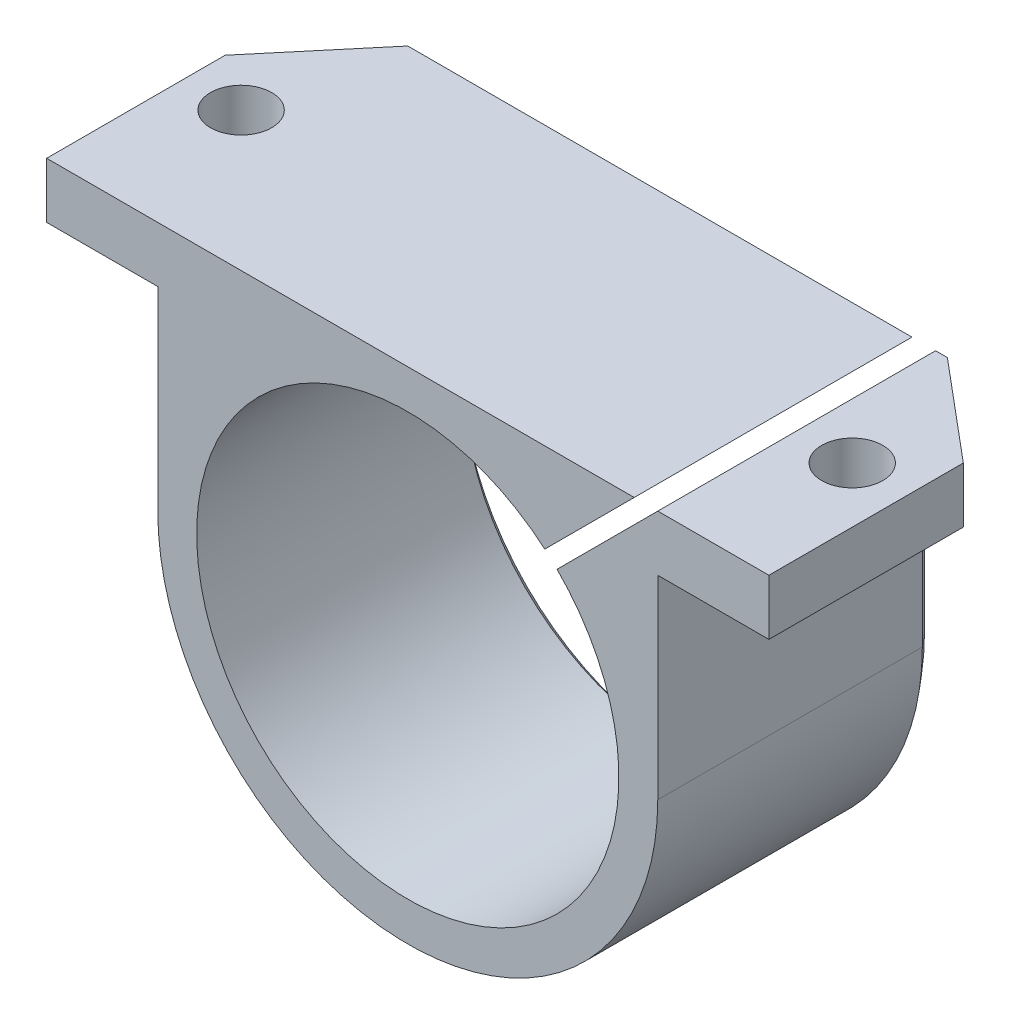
ISO-10303-21;
HEADER;
FILE_DESCRIPTION(('STEP AP214'),'2;1');
FILE_NAME('part.step','',(''),(''),'','','');
FILE_SCHEMA(('AUTOMOTIVE_DESIGN { 1 0 10303 214 1 1 1 1 }'));
ENDSEC;
DATA;
#1=APPLICATION_CONTEXT('core data for automotive mechanical design processes');
#2=APPLICATION_PROTOCOL_DEFINITION('international standard','automotive_design',2000,#1);
#3=PRODUCT_CONTEXT('',#1,'mechanical');
#4=PRODUCT('Part','Part','',(#3));
#5=PRODUCT_RELATED_PRODUCT_CATEGORY('part','',(#4));
#6=PRODUCT_DEFINITION_FORMATION('','',#4);
#7=PRODUCT_DEFINITION_CONTEXT('part definition',#1,'design');
#8=PRODUCT_DEFINITION('design','',#6,#7);
#9=PRODUCT_DEFINITION_SHAPE('','',#8);
#10=(LENGTH_UNIT() NAMED_UNIT(*) SI_UNIT(.MILLI.,.METRE.));
#11=(NAMED_UNIT(*) PLANE_ANGLE_UNIT() SI_UNIT($,.RADIAN.));
#12=(NAMED_UNIT(*) SI_UNIT($,.STERADIAN.) SOLID_ANGLE_UNIT());
#13=UNCERTAINTY_MEASURE_WITH_UNIT(LENGTH_MEASURE(1.E-05),#10,'distance_accuracy_value','');
#14=(GEOMETRIC_REPRESENTATION_CONTEXT(3) GLOBAL_UNCERTAINTY_ASSIGNED_CONTEXT((#13)) GLOBAL_UNIT_ASSIGNED_CONTEXT((#10,
#11,#12)) REPRESENTATION_CONTEXT('',''));
#15=CARTESIAN_POINT('',(0.,0.,0.));
#16=DIRECTION('',(0.,0.,1.));
#17=DIRECTION('',(1.,0.,0.));
#18=AXIS2_PLACEMENT_3D('',#15,#16,#17);
#19=CARTESIAN_POINT('',(0.,0.,12.5));
#20=DIRECTION('',(0.,0.,-1.));
#21=DIRECTION('',(-1.,0.,0.));
#22=AXIS2_PLACEMENT_3D('',#19,#20,#21);
#23=CYLINDRICAL_SURFACE('',#22,19.);
#24=DIRECTION('',(0.,0.,-1.));
#25=VECTOR('',#24,1.);
#26=CARTESIAN_POINT('',(13.4350288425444,13.4350288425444,12.5));
#27=LINE('',#26,#25);
#28=CARTESIAN_POINT('',(13.4350288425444,13.4350288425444,12.5));
#29=VERTEX_POINT('',#28);
#30=CARTESIAN_POINT('',(13.4350288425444,13.4350288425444,-11.5));
#31=VERTEX_POINT('',#30);
#32=EDGE_CURVE('E235',#29,#31,#27,.T.);
#33=ORIENTED_EDGE('',*,*,#32,.T.);
#34=CARTESIAN_POINT('',(0.,0.,-11.5));
#35=DIRECTION('',(0.,0.,1.));
#36=DIRECTION('',(1.,0.,0.));
#37=AXIS2_PLACEMENT_3D('',#34,#35,#36);
#38=CIRCLE('',#37,19.);
#39=CARTESIAN_POINT('',(12.3324350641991,14.4537554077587,-11.5));
#40=VERTEX_POINT('',#39);
#41=EDGE_CURVE('E172',#31,#40,#38,.F.);
#42=ORIENTED_EDGE('',*,*,#41,.T.);
#43=DIRECTION('',(0.,0.,-1.));
#44=VECTOR('',#43,1.);
#45=CARTESIAN_POINT('',(12.3324350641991,14.4537554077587,12.5));
#46=LINE('',#45,#44);
#47=CARTESIAN_POINT('',(12.3324350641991,14.4537554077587,12.5));
#48=VERTEX_POINT('',#47);
#49=EDGE_CURVE('E165',#48,#40,#46,.T.);
#50=ORIENTED_EDGE('',*,*,#49,.F.);
#51=CARTESIAN_POINT('',(0.,0.,12.5));
#52=DIRECTION('',(0.,0.,1.));
#53=DIRECTION('',(1.,0.,0.));
#54=AXIS2_PLACEMENT_3D('',#51,#52,#53);
#55=CIRCLE('',#54,19.);
#56=EDGE_CURVE('E169',#48,#29,#55,.T.);
#57=ORIENTED_EDGE('',*,*,#56,.T.);
#58=EDGE_LOOP('',(#33,#42,#50,#57));
#59=FACE_BOUND('',#58,.T.);
#60=ADVANCED_FACE('F41',(#59),#23,.F.);
#61=CARTESIAN_POINT('',(-1.06066017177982,1.06066017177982,12.5));
#62=DIRECTION('',(-0.707106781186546,0.707106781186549,0.));
#63=DIRECTION('',(-0.707106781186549,-0.707106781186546,0.));
#64=AXIS2_PLACEMENT_3D('',#61,#62,#63);
#65=PLANE('',#64);
#66=ORIENTED_EDGE('',*,*,#49,.T.);
#67=CARTESIAN_POINT('',(12.3324350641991,14.4537554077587,-11.5));
#68=CARTESIAN_POINT('',(12.4733086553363,14.5946289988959,-11.666649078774));
#69=CARTESIAN_POINT('',(12.6141770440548,14.7354973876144,-11.8333069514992));
#70=CARTESIAN_POINT('',(12.8959034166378,15.0172237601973,-12.1666402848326));
#71=CARTESIAN_POINT('',(13.0367614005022,15.1580817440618,-12.3333157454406));
#72=CARTESIAN_POINT('',(13.1776141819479,15.2989345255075,-12.5));
#73=B_SPLINE_CURVE_WITH_KNOTS('',3,(#67,#68,#69,#70,#71,#72),.UNSPECIFIED.,.F.,.F.,(4,2,4),(0.,
0.779207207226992,1.55841441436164),.UNSPECIFIED.);
#74=CARTESIAN_POINT('',(13.1776141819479,15.2989345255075,-12.5));
#75=VERTEX_POINT('',#74);
#76=EDGE_CURVE('E337',#40,#75,#73,.T.);
#77=ORIENTED_EDGE('',*,*,#76,.T.);
#78=DIRECTION('',(0.707106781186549,0.707106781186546,0.));
#79=VECTOR('',#78,1.);
#80=CARTESIAN_POINT('',(-1.06066017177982,1.06066017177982,-12.5));
#81=LINE('',#80,#79);
#82=CARTESIAN_POINT('',(20.3786796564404,22.5,-12.5));
#83=VERTEX_POINT('',#82);
#84=EDGE_CURVE('E236',#75,#83,#81,.T.);
#85=ORIENTED_EDGE('',*,*,#84,.T.);
#86=DIRECTION('',(0.,0.,-1.));
#87=VECTOR('',#86,1.);
#88=CARTESIAN_POINT('',(20.3786796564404,22.5,12.5));
#89=LINE('',#88,#87);
#90=CARTESIAN_POINT('',(20.3786796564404,22.5,12.5));
#91=VERTEX_POINT('',#90);
#92=EDGE_CURVE('E177',#91,#83,#89,.T.);
#93=ORIENTED_EDGE('',*,*,#92,.F.);
#94=DIRECTION('',(0.707106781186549,0.707106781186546,0.));
#95=VECTOR('',#94,1.);
#96=CARTESIAN_POINT('',(-1.06066017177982,1.06066017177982,12.5));
#97=LINE('',#96,#95);
#98=EDGE_CURVE('E180',#48,#91,#97,.T.);
#99=ORIENTED_EDGE('',*,*,#98,.F.);
#100=EDGE_LOOP('',(#66,#77,#85,#93,#99));
#101=FACE_BOUND('',#100,.T.);
#102=ADVANCED_FACE('F181',(#101),#65,.F.);
#103=CARTESIAN_POINT('',(0.,22.5,12.5));
#104=DIRECTION('',(0.,1.,0.));
#105=DIRECTION('',(0.,0.,1.));
#106=AXIS2_PLACEMENT_3D('',#103,#104,#105);
#107=PLANE('',#106);
#108=CARTESIAN_POINT('',(-27.5,22.5,0.));
#109=DIRECTION('',(0.,1.,0.));
#110=DIRECTION('',(0.,0.,1.));
#111=AXIS2_PLACEMENT_3D('',#108,#109,#110);
#112=CIRCLE('',#111,2.75);
#113=CARTESIAN_POINT('',(-27.5,22.5,2.75));
#114=VERTEX_POINT('',#113);
#115=EDGE_CURVE('E429',#114,#114,#112,.T.);
#116=ORIENTED_EDGE('',*,*,#115,.F.);
#117=EDGE_LOOP('',(#116));
#118=FACE_BOUND('',#117,.T.);
#119=DIRECTION('',(1.,0.,0.));
#120=VECTOR('',#119,1.);
#121=CARTESIAN_POINT('',(0.,22.5,-12.5));
#122=LINE('',#121,#120);
#123=CARTESIAN_POINT('',(-25.,22.5,-12.5));
#124=VERTEX_POINT('',#123);
#125=EDGE_CURVE('E239',#124,#83,#122,.T.);
#126=ORIENTED_EDGE('',*,*,#125,.F.);
#127=DIRECTION('',(0.64278760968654,0.,-0.766044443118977));
#128=VECTOR('',#127,1.);
#129=CARTESIAN_POINT('',(-26.9806991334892,22.5,-10.139494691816));
#130=LINE('',#129,#128);
#131=CARTESIAN_POINT('',(-32.5,22.5,-3.56184805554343));
#132=VERTEX_POINT('',#131);
#133=EDGE_CURVE('E315',#124,#132,#130,.F.);
#134=ORIENTED_EDGE('',*,*,#133,.T.);
#135=DIRECTION('',(0.,0.,-1.));
#136=VECTOR('',#135,1.);
#137=CARTESIAN_POINT('',(-32.5,22.5,12.5));
#138=LINE('',#137,#136);
#139=CARTESIAN_POINT('',(-32.5,22.5,12.5));
#140=VERTEX_POINT('',#139);
#141=EDGE_CURVE('E284',#140,#132,#138,.T.);
#142=ORIENTED_EDGE('',*,*,#141,.F.);
#143=DIRECTION('',(1.,0.,0.));
#144=VECTOR('',#143,1.);
#145=CARTESIAN_POINT('',(0.,22.5,12.5));
#146=LINE('',#145,#144);
#147=EDGE_CURVE('E187',#140,#91,#146,.T.);
#148=ORIENTED_EDGE('',*,*,#147,.T.);
#149=ORIENTED_EDGE('',*,*,#92,.T.);
#150=EDGE_LOOP('',(#126,#134,#142,#148,#149));
#151=FACE_BOUND('',#150,.T.);
#152=ADVANCED_FACE('F356',(#118,#151),#107,.T.);
#153=CARTESIAN_POINT('',(-32.5,0.,12.5));
#154=DIRECTION('',(1.,0.,0.));
#155=DIRECTION('',(0.,0.,-1.));
#156=AXIS2_PLACEMENT_3D('',#153,#154,#155);
#157=PLANE('',#156);
#158=ORIENTED_EDGE('',*,*,#141,.T.);
#159=DIRECTION('',(0.,-1.,0.));
#160=VECTOR('',#159,1.);
#161=CARTESIAN_POINT('',(-32.5,0.,-3.56184805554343));
#162=LINE('',#161,#160);
#163=CARTESIAN_POINT('',(-32.5,17.5,-3.56184805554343));
#164=VERTEX_POINT('',#163);
#165=EDGE_CURVE('E308',#132,#164,#162,.T.);
#166=ORIENTED_EDGE('',*,*,#165,.T.);
#167=DIRECTION('',(0.,0.,-1.));
#168=VECTOR('',#167,1.);
#169=CARTESIAN_POINT('',(-32.5,17.5,12.5));
#170=LINE('',#169,#168);
#171=CARTESIAN_POINT('',(-32.5,17.5,12.5));
#172=VERTEX_POINT('',#171);
#173=EDGE_CURVE('E280',#172,#164,#170,.T.);
#174=ORIENTED_EDGE('',*,*,#173,.F.);
#175=DIRECTION('',(0.,-1.,0.));
#176=VECTOR('',#175,1.);
#177=CARTESIAN_POINT('',(-32.5,0.,12.5));
#178=LINE('',#177,#176);
#179=EDGE_CURVE('E205',#140,#172,#178,.T.);
#180=ORIENTED_EDGE('',*,*,#179,.F.);
#181=EDGE_LOOP('',(#158,#166,#174,#180));
#182=FACE_BOUND('',#181,.T.);
#183=ADVANCED_FACE('F378',(#182),#157,.F.);
#184=CARTESIAN_POINT('',(0.,17.5,12.5));
#185=DIRECTION('',(0.,1.,0.));
#186=DIRECTION('',(0.,0.,1.));
#187=AXIS2_PLACEMENT_3D('',#184,#185,#186);
#188=PLANE('',#187);
#189=CARTESIAN_POINT('',(-27.5,17.5,0.));
#190=DIRECTION('',(0.,1.,0.));
#191=DIRECTION('',(0.,0.,1.));
#192=AXIS2_PLACEMENT_3D('',#189,#190,#191);
#193=CIRCLE('',#192,2.75);
#194=CARTESIAN_POINT('',(-27.5,17.5,2.75));
#195=VERTEX_POINT('',#194);
#196=EDGE_CURVE('E240',#195,#195,#193,.T.);
#197=ORIENTED_EDGE('',*,*,#196,.T.);
#198=EDGE_LOOP('',(#197));
#199=FACE_BOUND('',#198,.T.);
#200=ORIENTED_EDGE('',*,*,#173,.T.);
#201=DIRECTION('',(-0.64278760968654,0.,0.766044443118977));
#202=VECTOR('',#201,1.);
#203=CARTESIAN_POINT('',(-32.5,17.5,-3.56184805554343));
#204=LINE('',#203,#202);
#205=CARTESIAN_POINT('',(-25.,17.5,-12.5));
#206=VERTEX_POINT('',#205);
#207=EDGE_CURVE('E312',#164,#206,#204,.F.);
#208=ORIENTED_EDGE('',*,*,#207,.T.);
#209=DIRECTION('',(1.,0.,0.));
#210=VECTOR('',#209,1.);
#211=CARTESIAN_POINT('',(0.,17.5,-12.5));
#212=LINE('',#211,#210);
#213=CARTESIAN_POINT('',(-21.5,17.5,-12.5));
#214=VERTEX_POINT('',#213);
#215=EDGE_CURVE('E244',#206,#214,#212,.T.);
#216=ORIENTED_EDGE('',*,*,#215,.T.);
#217=DIRECTION('',(0.642787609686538,0.,-0.766044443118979));
#218=VECTOR('',#217,1.);
#219=CARTESIAN_POINT('',(-24.9268148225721,17.5,-8.41608112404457));
#220=LINE('',#219,#218);
#221=CARTESIAN_POINT('',(-22.5,17.5,-11.3082464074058));
#222=VERTEX_POINT('',#221);
#223=EDGE_CURVE('E51',#214,#222,#220,.F.);
#224=ORIENTED_EDGE('',*,*,#223,.T.);
#225=DIRECTION('',(0.,0.,-1.));
#226=VECTOR('',#225,1.);
#227=CARTESIAN_POINT('',(-22.5,17.5,12.5));
#228=LINE('',#227,#226);
#229=CARTESIAN_POINT('',(-22.5,17.5,12.5));
#230=VERTEX_POINT('',#229);
#231=EDGE_CURVE('E276',#230,#222,#228,.T.);
#232=ORIENTED_EDGE('',*,*,#231,.F.);
#233=DIRECTION('',(1.,0.,0.));
#234=VECTOR('',#233,1.);
#235=CARTESIAN_POINT('',(0.,17.5,12.5));
#236=LINE('',#235,#234);
#237=EDGE_CURVE('E208',#172,#230,#236,.T.);
#238=ORIENTED_EDGE('',*,*,#237,.F.);
#239=EDGE_LOOP('',(#200,#208,#216,#224,#232,#238));
#240=FACE_BOUND('',#239,.T.);
#241=ADVANCED_FACE('F385',(#199,#240),#188,.F.);
#242=CARTESIAN_POINT('',(-22.5,0.,12.5));
#243=DIRECTION('',(1.,0.,0.));
#244=DIRECTION('',(0.,0.,-1.));
#245=AXIS2_PLACEMENT_3D('',#242,#243,#244);
#246=PLANE('',#245);
#247=ORIENTED_EDGE('',*,*,#231,.T.);
#248=DIRECTION('',(0.,-1.,0.));
#249=VECTOR('',#248,1.);
#250=CARTESIAN_POINT('',(-22.5,0.,-11.3082464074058));
#251=LINE('',#250,#249);
#252=CARTESIAN_POINT('',(-22.5,0.,-11.3082464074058));
#253=VERTEX_POINT('',#252);
#254=EDGE_CURVE('E346',#222,#253,#251,.T.);
#255=ORIENTED_EDGE('',*,*,#254,.T.);
#256=DIRECTION('',(0.,0.,-1.));
#257=VECTOR('',#256,1.);
#258=CARTESIAN_POINT('',(-22.5,0.,12.5));
#259=LINE('',#258,#257);
#260=CARTESIAN_POINT('',(-22.5,0.,12.5));
#261=VERTEX_POINT('',#260);
#262=EDGE_CURVE('E273',#261,#253,#259,.T.);
#263=ORIENTED_EDGE('',*,*,#262,.F.);
#264=DIRECTION('',(0.,-1.,0.));
#265=VECTOR('',#264,1.);
#266=CARTESIAN_POINT('',(-22.5,0.,12.5));
#267=LINE('',#266,#265);
#268=EDGE_CURVE('E211',#230,#261,#267,.T.);
#269=ORIENTED_EDGE('',*,*,#268,.F.);
#270=EDGE_LOOP('',(#247,#255,#263,#269));
#271=FACE_BOUND('',#270,.T.);
#272=ADVANCED_FACE('F390',(#271),#246,.F.);
#273=CARTESIAN_POINT('',(0.,0.,12.5));
#274=DIRECTION('',(0.,0.,-1.));
#275=DIRECTION('',(-1.,0.,0.));
#276=AXIS2_PLACEMENT_3D('',#273,#274,#275);
#277=CYLINDRICAL_SURFACE('',#276,22.5);
#278=ORIENTED_EDGE('',*,*,#262,.T.);
#279=CARTESIAN_POINT('',(0.,0.,-11.3082464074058));
#280=DIRECTION('',(0.,0.,1.));
#281=DIRECTION('',(1.,0.,0.));
#282=AXIS2_PLACEMENT_3D('',#279,#280,#281);
#283=CIRCLE('',#282,22.5);
#284=CARTESIAN_POINT('',(22.5,0.,-11.3082464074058));
#285=VERTEX_POINT('',#284);
#286=EDGE_CURVE('E59',#253,#285,#283,.T.);
#287=ORIENTED_EDGE('',*,*,#286,.T.);
#288=DIRECTION('',(0.,0.,-1.));
#289=VECTOR('',#288,1.);
#290=CARTESIAN_POINT('',(22.5,0.,12.5));
#291=LINE('',#290,#289);
#292=CARTESIAN_POINT('',(22.5,0.,12.5));
#293=VERTEX_POINT('',#292);
#294=EDGE_CURVE('E270',#293,#285,#291,.T.);
#295=ORIENTED_EDGE('',*,*,#294,.F.);
#296=CARTESIAN_POINT('',(0.,0.,12.5));
#297=DIRECTION('',(0.,0.,1.));
#298=DIRECTION('',(1.,0.,0.));
#299=AXIS2_PLACEMENT_3D('',#296,#297,#298);
#300=CIRCLE('',#299,22.5);
#301=EDGE_CURVE('E214',#261,#293,#300,.T.);
#302=ORIENTED_EDGE('',*,*,#301,.F.);
#303=EDGE_LOOP('',(#278,#287,#295,#302));
#304=FACE_BOUND('',#303,.T.);
#305=ADVANCED_FACE('F392',(#304),#277,.T.);
#306=CARTESIAN_POINT('',(22.5,0.,12.5));
#307=DIRECTION('',(1.,0.,0.));
#308=DIRECTION('',(0.,0.,-1.));
#309=AXIS2_PLACEMENT_3D('',#306,#307,#308);
#310=PLANE('',#309);
#311=ORIENTED_EDGE('',*,*,#294,.T.);
#312=DIRECTION('',(0.,1.,0.));
#313=VECTOR('',#312,1.);
#314=CARTESIAN_POINT('',(22.5,17.5,-11.3082464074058));
#315=LINE('',#314,#313);
#316=CARTESIAN_POINT('',(22.5,17.5,-11.3082464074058));
#317=VERTEX_POINT('',#316);
#318=EDGE_CURVE('E66',#285,#317,#315,.T.);
#319=ORIENTED_EDGE('',*,*,#318,.T.);
#320=DIRECTION('',(0.,0.,-1.));
#321=VECTOR('',#320,1.);
#322=CARTESIAN_POINT('',(22.5,17.5,12.5));
#323=LINE('',#322,#321);
#324=CARTESIAN_POINT('',(22.5,17.5,12.5));
#325=VERTEX_POINT('',#324);
#326=EDGE_CURVE('E267',#325,#317,#323,.T.);
#327=ORIENTED_EDGE('',*,*,#326,.F.);
#328=DIRECTION('',(0.,-1.,0.));
#329=VECTOR('',#328,1.);
#330=CARTESIAN_POINT('',(22.5,0.,12.5));
#331=LINE('',#330,#329);
#332=EDGE_CURVE('E217',#325,#293,#331,.T.);
#333=ORIENTED_EDGE('',*,*,#332,.T.);
#334=EDGE_LOOP('',(#311,#319,#327,#333));
#335=FACE_BOUND('',#334,.T.);
#336=ADVANCED_FACE('F449',(#335),#310,.T.);
#337=CARTESIAN_POINT('',(0.,17.5,12.5));
#338=DIRECTION('',(0.,-1.,0.));
#339=DIRECTION('',(0.,0.,-1.));
#340=AXIS2_PLACEMENT_3D('',#337,#338,#339);
#341=PLANE('',#340);
#342=CARTESIAN_POINT('',(27.5,17.5,0.));
#343=DIRECTION('',(0.,-1.,0.));
#344=DIRECTION('',(0.,0.,-1.));
#345=AXIS2_PLACEMENT_3D('',#342,#343,#344);
#346=CIRCLE('',#345,2.75);
#347=CARTESIAN_POINT('',(27.5,17.5,2.74999999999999));
#348=VERTEX_POINT('',#347);
#349=EDGE_CURVE('E200',#348,#348,#346,.T.);
#350=ORIENTED_EDGE('',*,*,#349,.F.);
#351=EDGE_LOOP('',(#350));
#352=FACE_BOUND('',#351,.T.);
#353=DIRECTION('',(-1.,0.,0.));
#354=VECTOR('',#353,1.);
#355=CARTESIAN_POINT('',(0.,17.5,-12.5));
#356=LINE('',#355,#354);
#357=CARTESIAN_POINT('',(23.5618480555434,17.5,-12.5));
#358=VERTEX_POINT('',#357);
#359=CARTESIAN_POINT('',(21.5,17.5,-12.5));
#360=VERTEX_POINT('',#359);
#361=EDGE_CURVE('E247',#358,#360,#356,.T.);
#362=ORIENTED_EDGE('',*,*,#361,.F.);
#363=DIRECTION('',(0.766044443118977,0.,0.64278760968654));
#364=VECTOR('',#363,1.);
#365=CARTESIAN_POINT('',(22.0452849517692,17.5,-13.772547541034));
#366=LINE('',#365,#364);
#367=CARTESIAN_POINT('',(32.5,17.5,-4.99999999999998));
#368=VERTEX_POINT('',#367);
#369=EDGE_CURVE('E299',#358,#368,#366,.T.);
#370=ORIENTED_EDGE('',*,*,#369,.T.);
#371=DIRECTION('',(0.,0.,-1.));
#372=VECTOR('',#371,1.);
#373=CARTESIAN_POINT('',(32.5,17.5,12.5));
#374=LINE('',#373,#372);
#375=CARTESIAN_POINT('',(32.5,17.5,12.5));
#376=VERTEX_POINT('',#375);
#377=EDGE_CURVE('E263',#376,#368,#374,.T.);
#378=ORIENTED_EDGE('',*,*,#377,.F.);
#379=DIRECTION('',(-1.,0.,0.));
#380=VECTOR('',#379,1.);
#381=CARTESIAN_POINT('',(0.,17.5,12.5));
#382=LINE('',#381,#380);
#383=EDGE_CURVE('E221',#376,#325,#382,.T.);
#384=ORIENTED_EDGE('',*,*,#383,.T.);
#385=ORIENTED_EDGE('',*,*,#326,.T.);
#386=DIRECTION('',(-0.642787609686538,0.,-0.766044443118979));
#387=VECTOR('',#386,1.);
#388=CARTESIAN_POINT('',(21.5,17.5,-12.5));
#389=LINE('',#388,#387);
#390=EDGE_CURVE('E11',#317,#360,#389,.T.);
#391=ORIENTED_EDGE('',*,*,#390,.T.);
#392=EDGE_LOOP('',(#362,#370,#378,#384,#385,#391));
#393=FACE_BOUND('',#392,.T.);
#394=ADVANCED_FACE('F398',(#352,#393),#341,.T.);
#395=CARTESIAN_POINT('',(32.5,0.,12.5));
#396=DIRECTION('',(1.,0.,0.));
#397=DIRECTION('',(0.,0.,-1.));
#398=AXIS2_PLACEMENT_3D('',#395,#396,#397);
#399=PLANE('',#398);
#400=ORIENTED_EDGE('',*,*,#377,.T.);
#401=DIRECTION('',(0.,1.,0.));
#402=VECTOR('',#401,1.);
#403=CARTESIAN_POINT('',(32.5,22.5,-4.99999999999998));
#404=LINE('',#403,#402);
#405=CARTESIAN_POINT('',(32.5,22.5,-4.99999999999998));
#406=VERTEX_POINT('',#405);
#407=EDGE_CURVE('E302',#368,#406,#404,.T.);
#408=ORIENTED_EDGE('',*,*,#407,.T.);
#409=DIRECTION('',(0.,0.,-1.));
#410=VECTOR('',#409,1.);
#411=CARTESIAN_POINT('',(32.5,22.5,12.5));
#412=LINE('',#411,#410);
#413=CARTESIAN_POINT('',(32.5,22.5,12.5));
#414=VERTEX_POINT('',#413);
#415=EDGE_CURVE('E259',#414,#406,#412,.T.);
#416=ORIENTED_EDGE('',*,*,#415,.F.);
#417=DIRECTION('',(0.,-1.,0.));
#418=VECTOR('',#417,1.);
#419=CARTESIAN_POINT('',(32.5,0.,12.5));
#420=LINE('',#419,#418);
#421=EDGE_CURVE('E225',#414,#376,#420,.T.);
#422=ORIENTED_EDGE('',*,*,#421,.T.);
#423=EDGE_LOOP('',(#400,#408,#416,#422));
#424=FACE_BOUND('',#423,.T.);
#425=ADVANCED_FACE('F402',(#424),#399,.T.);
#426=CARTESIAN_POINT('',(0.,22.5,12.5));
#427=DIRECTION('',(0.,1.,0.));
#428=DIRECTION('',(0.,0.,1.));
#429=AXIS2_PLACEMENT_3D('',#426,#427,#428);
#430=PLANE('',#429);
#431=CARTESIAN_POINT('',(27.5,22.5,0.));
#432=DIRECTION('',(0.,1.,0.));
#433=DIRECTION('',(0.,0.,1.));
#434=AXIS2_PLACEMENT_3D('',#431,#432,#433);
#435=CIRCLE('',#434,2.75);
#436=CARTESIAN_POINT('',(27.5,22.5,2.74999999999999));
#437=VERTEX_POINT('',#436);
#438=EDGE_CURVE('E434',#437,#437,#435,.T.);
#439=ORIENTED_EDGE('',*,*,#438,.F.);
#440=EDGE_LOOP('',(#439));
#441=FACE_BOUND('',#440,.T.);
#442=ORIENTED_EDGE('',*,*,#415,.T.);
#443=DIRECTION('',(-0.766044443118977,0.,-0.64278760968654));
#444=VECTOR('',#443,1.);
#445=CARTESIAN_POINT('',(22.0452849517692,22.5,-13.772547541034));
#446=LINE('',#445,#444);
#447=CARTESIAN_POINT('',(23.5618480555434,22.5,-12.5));
#448=VERTEX_POINT('',#447);
#449=EDGE_CURVE('E305',#406,#448,#446,.T.);
#450=ORIENTED_EDGE('',*,*,#449,.T.);
#451=DIRECTION('',(1.,0.,0.));
#452=VECTOR('',#451,1.);
#453=CARTESIAN_POINT('',(0.,22.5,-12.5));
#454=LINE('',#453,#452);
#455=CARTESIAN_POINT('',(22.5000000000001,22.5,-12.5));
#456=VERTEX_POINT('',#455);
#457=EDGE_CURVE('E197',#456,#448,#454,.T.);
#458=ORIENTED_EDGE('',*,*,#457,.F.);
#459=DIRECTION('',(0.,0.,-1.));
#460=VECTOR('',#459,1.);
#461=CARTESIAN_POINT('',(22.5000000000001,22.5,12.5));
#462=LINE('',#461,#460);
#463=CARTESIAN_POINT('',(22.5000000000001,22.5,12.5));
#464=VERTEX_POINT('',#463);
#465=EDGE_CURVE('E255',#464,#456,#462,.T.);
#466=ORIENTED_EDGE('',*,*,#465,.F.);
#467=DIRECTION('',(1.,0.,0.));
#468=VECTOR('',#467,1.);
#469=CARTESIAN_POINT('',(0.,22.5,12.5));
#470=LINE('',#469,#468);
#471=EDGE_CURVE('E229',#464,#414,#470,.T.);
#472=ORIENTED_EDGE('',*,*,#471,.T.);
#473=EDGE_LOOP('',(#442,#450,#458,#466,#472));
#474=FACE_BOUND('',#473,.T.);
#475=ADVANCED_FACE('F407',(#441,#474),#430,.T.);
#476=CARTESIAN_POINT('',(0.,0.,12.5));
#477=DIRECTION('',(-0.707106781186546,0.707106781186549,0.));
#478=DIRECTION('',(-0.707106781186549,-0.707106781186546,0.));
#479=AXIS2_PLACEMENT_3D('',#476,#477,#478);
#480=PLANE('',#479);
#481=DIRECTION('',(0.707106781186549,0.707106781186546,0.));
#482=VECTOR('',#481,1.);
#483=CARTESIAN_POINT('',(0.,0.,-12.5));
#484=LINE('',#483,#482);
#485=CARTESIAN_POINT('',(14.2777258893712,14.2777258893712,-12.5));
#486=VERTEX_POINT('',#485);
#487=EDGE_CURVE('E194',#486,#456,#484,.T.);
#488=ORIENTED_EDGE('',*,*,#487,.F.);
#489=DIRECTION('',(0.541675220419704,0.541675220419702,-0.642787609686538));
#490=VECTOR('',#489,1.);
#491=CARTESIAN_POINT('',(0.,0.,4.44289299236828));
#492=LINE('',#491,#490);
#493=EDGE_CURVE('E332',#486,#31,#492,.F.);
#494=ORIENTED_EDGE('',*,*,#493,.T.);
#495=ORIENTED_EDGE('',*,*,#32,.F.);
#496=DIRECTION('',(0.707106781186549,0.707106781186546,0.));
#497=VECTOR('',#496,1.);
#498=CARTESIAN_POINT('',(0.,0.,12.5));
#499=LINE('',#498,#497);
#500=EDGE_CURVE('E192',#29,#464,#499,.T.);
#501=ORIENTED_EDGE('',*,*,#500,.T.);
#502=ORIENTED_EDGE('',*,*,#465,.T.);
#503=EDGE_LOOP('',(#488,#494,#495,#501,#502));
#504=FACE_BOUND('',#503,.T.);
#505=ADVANCED_FACE('F414',(#504),#480,.T.);
#506=CARTESIAN_POINT('',(0.,0.,12.5));
#507=DIRECTION('',(0.,0.,1.));
#508=DIRECTION('',(1.,0.,0.));
#509=AXIS2_PLACEMENT_3D('',#506,#507,#508);
#510=PLANE('',#509);
#511=ORIENTED_EDGE('',*,*,#56,.F.);
#512=ORIENTED_EDGE('',*,*,#98,.T.);
#513=ORIENTED_EDGE('',*,*,#147,.F.);
#514=ORIENTED_EDGE('',*,*,#179,.T.);
#515=ORIENTED_EDGE('',*,*,#237,.T.);
#516=ORIENTED_EDGE('',*,*,#268,.T.);
#517=ORIENTED_EDGE('',*,*,#301,.T.);
#518=ORIENTED_EDGE('',*,*,#332,.F.);
#519=ORIENTED_EDGE('',*,*,#383,.F.);
#520=ORIENTED_EDGE('',*,*,#421,.F.);
#521=ORIENTED_EDGE('',*,*,#471,.F.);
#522=ORIENTED_EDGE('',*,*,#500,.F.);
#523=EDGE_LOOP('',(#511,#512,#513,#514,#515,#516,#517,#518,#519,#520,#521,#522));
#524=FACE_BOUND('',#523,.T.);
#525=ADVANCED_FACE('F189',(#524),#510,.T.);
#526=CARTESIAN_POINT('',(0.,0.,-12.5));
#527=DIRECTION('',(0.,0.,1.));
#528=DIRECTION('',(1.,0.,0.));
#529=AXIS2_PLACEMENT_3D('',#526,#527,#528);
#530=PLANE('',#529);
#531=ORIENTED_EDGE('',*,*,#84,.F.);
#532=CARTESIAN_POINT('',(0.,0.,-12.5));
#533=DIRECTION('',(0.,0.,1.));
#534=DIRECTION('',(1.,0.,0.));
#535=AXIS2_PLACEMENT_3D('',#532,#533,#534);
#536=CIRCLE('',#535,20.1917535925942);
#537=EDGE_CURVE('E328',#75,#486,#536,.T.);
#538=ORIENTED_EDGE('',*,*,#537,.T.);
#539=ORIENTED_EDGE('',*,*,#487,.T.);
#540=ORIENTED_EDGE('',*,*,#457,.T.);
#541=DIRECTION('',(0.,-1.,0.));
#542=VECTOR('',#541,1.);
#543=CARTESIAN_POINT('',(23.5618480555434,17.5,-12.5));
#544=LINE('',#543,#542);
#545=EDGE_CURVE('E295',#448,#358,#544,.T.);
#546=ORIENTED_EDGE('',*,*,#545,.T.);
#547=ORIENTED_EDGE('',*,*,#361,.T.);
#548=DIRECTION('',(0.,-1.,0.));
#549=VECTOR('',#548,1.);
#550=CARTESIAN_POINT('',(21.5,0.,-12.5));
#551=LINE('',#550,#549);
#552=CARTESIAN_POINT('',(21.5,0.,-12.5));
#553=VERTEX_POINT('',#552);
#554=EDGE_CURVE('E321',#360,#553,#551,.T.);
#555=ORIENTED_EDGE('',*,*,#554,.T.);
#556=CARTESIAN_POINT('',(0.,0.,-12.5));
#557=DIRECTION('',(0.,0.,1.));
#558=DIRECTION('',(1.,0.,0.));
#559=AXIS2_PLACEMENT_3D('',#556,#557,#558);
#560=CIRCLE('',#559,21.5);
#561=CARTESIAN_POINT('',(-21.5,0.,-12.5));
#562=VERTEX_POINT('',#561);
#563=EDGE_CURVE('E318',#553,#562,#560,.F.);
#564=ORIENTED_EDGE('',*,*,#563,.T.);
#565=DIRECTION('',(0.,1.,0.));
#566=VECTOR('',#565,1.);
#567=CARTESIAN_POINT('',(-21.5,0.,-12.5));
#568=LINE('',#567,#566);
#569=EDGE_CURVE('E324',#562,#214,#568,.T.);
#570=ORIENTED_EDGE('',*,*,#569,.T.);
#571=ORIENTED_EDGE('',*,*,#215,.F.);
#572=DIRECTION('',(0.,1.,0.));
#573=VECTOR('',#572,1.);
#574=CARTESIAN_POINT('',(-25.,0.,-12.5));
#575=LINE('',#574,#573);
#576=EDGE_CURVE('E176',#206,#124,#575,.T.);
#577=ORIENTED_EDGE('',*,*,#576,.T.);
#578=ORIENTED_EDGE('',*,*,#125,.T.);
#579=EDGE_LOOP('',(#531,#538,#539,#540,#546,#547,#555,#564,#570,#571,#577,#578));
#580=FACE_BOUND('',#579,.T.);
#581=ADVANCED_FACE('F410',(#580),#530,.F.);
#582=CARTESIAN_POINT('',(27.5,-22.5,0.));
#583=DIRECTION('',(0.,1.,0.));
#584=DIRECTION('',(0.,0.,1.));
#585=AXIS2_PLACEMENT_3D('',#582,#583,#584);
#586=CYLINDRICAL_SURFACE('',#585,2.75);
#587=CARTESIAN_POINT('',(27.5,17.5,2.74999999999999));
#588=CARTESIAN_POINT('',(27.5,17.5520833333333,2.74999999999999));
#589=CARTESIAN_POINT('',(27.5,17.6041666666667,2.74999999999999));
#590=CARTESIAN_POINT('',(27.5,17.7083333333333,2.74999999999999));
#591=CARTESIAN_POINT('',(27.5,17.7604166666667,2.74999999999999));
#592=CARTESIAN_POINT('',(27.5,17.8645833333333,2.74999999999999));
#593=CARTESIAN_POINT('',(27.5,17.9166666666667,2.74999999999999));
#594=CARTESIAN_POINT('',(27.5,18.0208333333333,2.74999999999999));
#595=CARTESIAN_POINT('',(27.5,18.0729166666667,2.74999999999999));
#596=CARTESIAN_POINT('',(27.5,18.1770833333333,2.74999999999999));
#597=CARTESIAN_POINT('',(27.5,18.2291666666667,2.74999999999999));
#598=CARTESIAN_POINT('',(27.5,18.3333333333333,2.74999999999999));
#599=CARTESIAN_POINT('',(27.5,18.3854166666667,2.74999999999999));
#600=CARTESIAN_POINT('',(27.5,18.4895833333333,2.74999999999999));
#601=CARTESIAN_POINT('',(27.5,18.5416666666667,2.74999999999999));
#602=CARTESIAN_POINT('',(27.5,18.6458333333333,2.74999999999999));
#603=CARTESIAN_POINT('',(27.5,18.6979166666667,2.74999999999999));
#604=CARTESIAN_POINT('',(27.5,18.8020833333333,2.74999999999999));
#605=CARTESIAN_POINT('',(27.5,18.8541666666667,2.74999999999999));
#606=CARTESIAN_POINT('',(27.5,18.9583333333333,2.74999999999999));
#607=CARTESIAN_POINT('',(27.5,19.0104166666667,2.74999999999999));
#608=CARTESIAN_POINT('',(27.5,19.1145833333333,2.74999999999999));
#609=CARTESIAN_POINT('',(27.5,19.1666666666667,2.74999999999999));
#610=CARTESIAN_POINT('',(27.5,19.2708333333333,2.74999999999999));
#611=CARTESIAN_POINT('',(27.5,19.3229166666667,2.74999999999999));
#612=CARTESIAN_POINT('',(27.5,19.4270833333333,2.74999999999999));
#613=CARTESIAN_POINT('',(27.5,19.4791666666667,2.74999999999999));
#614=CARTESIAN_POINT('',(27.5,19.5833333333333,2.74999999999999));
#615=CARTESIAN_POINT('',(27.5,19.6354166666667,2.74999999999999));
#616=CARTESIAN_POINT('',(27.5,19.7395833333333,2.74999999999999));
#617=CARTESIAN_POINT('',(27.5,19.7916666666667,2.74999999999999));
#618=CARTESIAN_POINT('',(27.5,19.8958333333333,2.74999999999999));
#619=CARTESIAN_POINT('',(27.5,19.9479166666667,2.74999999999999));
#620=CARTESIAN_POINT('',(27.5,20.0520833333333,2.74999999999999));
#621=CARTESIAN_POINT('',(27.5,20.1041666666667,2.74999999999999));
#622=CARTESIAN_POINT('',(27.5,20.2083333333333,2.74999999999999));
#623=CARTESIAN_POINT('',(27.5,20.2604166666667,2.74999999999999));
#624=CARTESIAN_POINT('',(27.5,20.3645833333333,2.74999999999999));
#625=CARTESIAN_POINT('',(27.5,20.4166666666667,2.74999999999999));
#626=CARTESIAN_POINT('',(27.5,20.5208333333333,2.74999999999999));
#627=CARTESIAN_POINT('',(27.5,20.5729166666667,2.74999999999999));
#628=CARTESIAN_POINT('',(27.5,20.6770833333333,2.74999999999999));
#629=CARTESIAN_POINT('',(27.5,20.7291666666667,2.74999999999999));
#630=CARTESIAN_POINT('',(27.5,20.8333333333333,2.74999999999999));
#631=CARTESIAN_POINT('',(27.5,20.8854166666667,2.74999999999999));
#632=CARTESIAN_POINT('',(27.5,20.9895833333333,2.74999999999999));
#633=CARTESIAN_POINT('',(27.5,21.0416666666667,2.74999999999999));
#634=CARTESIAN_POINT('',(27.5,21.1458333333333,2.74999999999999));
#635=CARTESIAN_POINT('',(27.5,21.1979166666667,2.74999999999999));
#636=CARTESIAN_POINT('',(27.5,21.3020833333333,2.74999999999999));
#637=CARTESIAN_POINT('',(27.5,21.3541666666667,2.74999999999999));
#638=CARTESIAN_POINT('',(27.5,21.4583333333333,2.74999999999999));
#639=CARTESIAN_POINT('',(27.5,21.5104166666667,2.74999999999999));
#640=CARTESIAN_POINT('',(27.5,21.6145833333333,2.74999999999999));
#641=CARTESIAN_POINT('',(27.5,21.6666666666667,2.74999999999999));
#642=CARTESIAN_POINT('',(27.5,21.7708333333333,2.74999999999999));
#643=CARTESIAN_POINT('',(27.5,21.8229166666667,2.74999999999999));
#644=CARTESIAN_POINT('',(27.5,21.9270833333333,2.74999999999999));
#645=CARTESIAN_POINT('',(27.5,21.9791666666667,2.74999999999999));
#646=CARTESIAN_POINT('',(27.5,22.0833333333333,2.74999999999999));
#647=CARTESIAN_POINT('',(27.5,22.1354166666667,2.74999999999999));
#648=CARTESIAN_POINT('',(27.5,22.2395833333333,2.74999999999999));
#649=CARTESIAN_POINT('',(27.5,22.2916666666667,2.74999999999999));
#650=CARTESIAN_POINT('',(27.5,22.3958333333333,2.74999999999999));
#651=CARTESIAN_POINT('',(27.5,22.4479166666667,2.74999999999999));
#652=CARTESIAN_POINT('',(27.5,22.5,2.74999999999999));
#653=B_SPLINE_CURVE_WITH_KNOTS('',3,(#587,#588,#589,#590,#591,#592,#593,#594,#595,#596,#597,
#598,#599,#600,#601,#602,#603,#604,#605,#606,#607,#608,#609,#610,#611,#612,#613,#614,#615,#616,
#617,#618,#619,#620,#621,#622,#623,#624,#625,#626,#627,#628,#629,#630,#631,#632,#633,#634,#635,
#636,#637,#638,#639,#640,#641,#642,#643,#644,#645,#646,#647,#648,#649,#650,#651,#652),
.UNSPECIFIED.,.F.,.F.,(4,2,2,2,2,2,2,2,2,2,2,2,2,2,2,2,2,2,2,2,2,2,2,2,2,2,2,2,2,2,2,2,4),(0.,
0.156249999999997,0.3125,0.468749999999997,0.625000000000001,0.781249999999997,
0.937500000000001,1.09375,1.25,1.40625,1.56249999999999,1.71875,1.87499999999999,2.03125,2.1875,
2.34375,2.5,2.65624999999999,2.8125,2.96874999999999,3.125,3.28124999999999,3.4375,
3.59374999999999,3.74999999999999,3.90624999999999,4.06249999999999,4.21874999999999,
4.37499999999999,4.53124999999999,4.68749999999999,4.84374999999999,4.99999999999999),.UNSPECIFIED.);
#654=EDGE_CURVE('BSEAM446',#348,#437,#653,.T.);
#655=ORIENTED_EDGE('',*,*,#349,.T.);
#656=ORIENTED_EDGE('',*,*,#438,.T.);
#657=ORIENTED_EDGE('',*,*,#654,.T.);
#658=ORIENTED_EDGE('',*,*,#654,.F.);
#659=EDGE_LOOP('',(#655,#657,#656,#658));
#660=FACE_BOUND('',#659,.T.);
#661=ADVANCED_FACE('F446',(#660),#586,.F.);
#662=CARTESIAN_POINT('',(-27.5,-22.5,0.));
#663=DIRECTION('',(0.,1.,0.));
#664=DIRECTION('',(0.,0.,1.));
#665=AXIS2_PLACEMENT_3D('',#662,#663,#664);
#666=CYLINDRICAL_SURFACE('',#665,2.75);
#667=CARTESIAN_POINT('',(-27.5,22.5,2.75));
#668=CARTESIAN_POINT('',(-27.5,22.4479166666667,2.75));
#669=CARTESIAN_POINT('',(-27.5,22.3958333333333,2.75));
#670=CARTESIAN_POINT('',(-27.5,22.2916666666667,2.75));
#671=CARTESIAN_POINT('',(-27.5,22.2395833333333,2.75));
#672=CARTESIAN_POINT('',(-27.5,22.1354166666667,2.75));
#673=CARTESIAN_POINT('',(-27.5,22.0833333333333,2.75));
#674=CARTESIAN_POINT('',(-27.5,21.9791666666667,2.75));
#675=CARTESIAN_POINT('',(-27.5,21.9270833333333,2.75));
#676=CARTESIAN_POINT('',(-27.5,21.8229166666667,2.75));
#677=CARTESIAN_POINT('',(-27.5,21.7708333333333,2.75));
#678=CARTESIAN_POINT('',(-27.5,21.6666666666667,2.75));
#679=CARTESIAN_POINT('',(-27.5,21.6145833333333,2.75));
#680=CARTESIAN_POINT('',(-27.5,21.5104166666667,2.75));
#681=CARTESIAN_POINT('',(-27.5,21.4583333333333,2.75));
#682=CARTESIAN_POINT('',(-27.5,21.3541666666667,2.75));
#683=CARTESIAN_POINT('',(-27.5,21.3020833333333,2.75));
#684=CARTESIAN_POINT('',(-27.5,21.1979166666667,2.75));
#685=CARTESIAN_POINT('',(-27.5,21.1458333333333,2.75));
#686=CARTESIAN_POINT('',(-27.5,21.0416666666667,2.75));
#687=CARTESIAN_POINT('',(-27.5,20.9895833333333,2.75));
#688=CARTESIAN_POINT('',(-27.5,20.8854166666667,2.75));
#689=CARTESIAN_POINT('',(-27.5,20.8333333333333,2.75));
#690=CARTESIAN_POINT('',(-27.5,20.7291666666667,2.75));
#691=CARTESIAN_POINT('',(-27.5,20.6770833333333,2.75));
#692=CARTESIAN_POINT('',(-27.5,20.5729166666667,2.75));
#693=CARTESIAN_POINT('',(-27.5,20.5208333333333,2.75));
#694=CARTESIAN_POINT('',(-27.5,20.4166666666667,2.75));
#695=CARTESIAN_POINT('',(-27.5,20.3645833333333,2.75));
#696=CARTESIAN_POINT('',(-27.5,20.2604166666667,2.75));
#697=CARTESIAN_POINT('',(-27.5,20.2083333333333,2.75));
#698=CARTESIAN_POINT('',(-27.5,20.1041666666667,2.75));
#699=CARTESIAN_POINT('',(-27.5,20.0520833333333,2.75));
#700=CARTESIAN_POINT('',(-27.5,19.9479166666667,2.75));
#701=CARTESIAN_POINT('',(-27.5,19.8958333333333,2.75));
#702=CARTESIAN_POINT('',(-27.5,19.7916666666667,2.75));
#703=CARTESIAN_POINT('',(-27.5,19.7395833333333,2.75));
#704=CARTESIAN_POINT('',(-27.5,19.6354166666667,2.75));
#705=CARTESIAN_POINT('',(-27.5,19.5833333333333,2.75));
#706=CARTESIAN_POINT('',(-27.5,19.4791666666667,2.75));
#707=CARTESIAN_POINT('',(-27.5,19.4270833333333,2.75));
#708=CARTESIAN_POINT('',(-27.5,19.3229166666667,2.75));
#709=CARTESIAN_POINT('',(-27.5,19.2708333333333,2.75));
#710=CARTESIAN_POINT('',(-27.5,19.1666666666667,2.75));
#711=CARTESIAN_POINT('',(-27.5,19.1145833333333,2.75));
#712=CARTESIAN_POINT('',(-27.5,19.0104166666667,2.75));
#713=CARTESIAN_POINT('',(-27.5,18.9583333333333,2.75));
#714=CARTESIAN_POINT('',(-27.5,18.8541666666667,2.75));
#715=CARTESIAN_POINT('',(-27.5,18.8020833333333,2.75));
#716=CARTESIAN_POINT('',(-27.5,18.6979166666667,2.75));
#717=CARTESIAN_POINT('',(-27.5,18.6458333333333,2.75));
#718=CARTESIAN_POINT('',(-27.5,18.5416666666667,2.75));
#719=CARTESIAN_POINT('',(-27.5,18.4895833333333,2.75));
#720=CARTESIAN_POINT('',(-27.5,18.3854166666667,2.75));
#721=CARTESIAN_POINT('',(-27.5,18.3333333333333,2.75));
#722=CARTESIAN_POINT('',(-27.5,18.2291666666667,2.75));
#723=CARTESIAN_POINT('',(-27.5,18.1770833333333,2.75));
#724=CARTESIAN_POINT('',(-27.5,18.0729166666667,2.75));
#725=CARTESIAN_POINT('',(-27.5,18.0208333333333,2.75));
#726=CARTESIAN_POINT('',(-27.5,17.9166666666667,2.75));
#727=CARTESIAN_POINT('',(-27.5,17.8645833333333,2.75));
#728=CARTESIAN_POINT('',(-27.5,17.7604166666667,2.75));
#729=CARTESIAN_POINT('',(-27.5,17.7083333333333,2.75));
#730=CARTESIAN_POINT('',(-27.5,17.6041666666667,2.75));
#731=CARTESIAN_POINT('',(-27.5,17.5520833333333,2.75));
#732=CARTESIAN_POINT('',(-27.5,17.5,2.75));
#733=B_SPLINE_CURVE_WITH_KNOTS('',3,(#667,#668,#669,#670,#671,#672,#673,#674,#675,#676,#677,
#678,#679,#680,#681,#682,#683,#684,#685,#686,#687,#688,#689,#690,#691,#692,#693,#694,#695,#696,
#697,#698,#699,#700,#701,#702,#703,#704,#705,#706,#707,#708,#709,#710,#711,#712,#713,#714,#715,
#716,#717,#718,#719,#720,#721,#722,#723,#724,#725,#726,#727,#728,#729,#730,#731,#732),
.UNSPECIFIED.,.F.,.F.,(4,2,2,2,2,2,2,2,2,2,2,2,2,2,2,2,2,2,2,2,2,2,2,2,2,2,2,2,2,2,2,2,4),(0.,
0.156249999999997,0.3125,0.468750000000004,0.625000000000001,0.781249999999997,
0.937500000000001,1.09375,1.25,1.40625,1.5625,1.71875,1.875,2.03125,2.1875,2.34375000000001,2.5,
2.65625,2.8125,2.96875000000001,3.125,3.28125,3.4375,3.59375000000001,3.75,3.90625,4.0625,
4.21875000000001,4.375,4.53125,4.6875,4.84375000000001,5.),.UNSPECIFIED.);
#734=EDGE_CURVE('BSEAM363',#114,#195,#733,.T.);
#735=ORIENTED_EDGE('',*,*,#115,.T.);
#736=ORIENTED_EDGE('',*,*,#196,.F.);
#737=ORIENTED_EDGE('',*,*,#734,.T.);
#738=ORIENTED_EDGE('',*,*,#734,.F.);
#739=EDGE_LOOP('',(#735,#737,#736,#738));
#740=FACE_BOUND('',#739,.T.);
#741=ADVANCED_FACE('F363',(#740),#666,.F.);
#742=CARTESIAN_POINT('',(23.5618480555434,0.,-12.5));
#743=DIRECTION('',(0.64278760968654,0.,-0.766044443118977));
#744=DIRECTION('',(0.,1.,0.));
#745=AXIS2_PLACEMENT_3D('',#742,#743,#744);
#746=PLANE('',#745);
#747=ORIENTED_EDGE('',*,*,#449,.F.);
#748=ORIENTED_EDGE('',*,*,#407,.F.);
#749=ORIENTED_EDGE('',*,*,#369,.F.);
#750=ORIENTED_EDGE('',*,*,#545,.F.);
#751=EDGE_LOOP('',(#747,#748,#749,#750));
#752=FACE_BOUND('',#751,.T.);
#753=ADVANCED_FACE('F360',(#752),#746,.T.);
#754=CARTESIAN_POINT('',(-32.5,0.,-3.56184805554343));
#755=DIRECTION('',(0.766044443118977,0.,0.64278760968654));
#756=DIRECTION('',(0.,-1.,0.));
#757=AXIS2_PLACEMENT_3D('',#754,#755,#756);
#758=PLANE('',#757);
#759=ORIENTED_EDGE('',*,*,#133,.F.);
#760=ORIENTED_EDGE('',*,*,#576,.F.);
#761=ORIENTED_EDGE('',*,*,#207,.F.);
#762=ORIENTED_EDGE('',*,*,#165,.F.);
#763=EDGE_LOOP('',(#759,#760,#761,#762));
#764=FACE_BOUND('',#763,.T.);
#765=ADVANCED_FACE('F362',(#764),#758,.F.);
#766=CARTESIAN_POINT('',(0.,0.,-12.5));
#767=DIRECTION('',(0.,0.,-1.));
#768=DIRECTION('',(-1.,0.,0.));
#769=AXIS2_PLACEMENT_3D('',#766,#767,#768);
#770=CONICAL_SURFACE('',#769,20.1917535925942,0.872664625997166);
#771=ORIENTED_EDGE('',*,*,#76,.F.);
#772=ORIENTED_EDGE('',*,*,#41,.F.);
#773=ORIENTED_EDGE('',*,*,#493,.F.);
#774=ORIENTED_EDGE('',*,*,#537,.F.);
#775=EDGE_LOOP('',(#771,#772,#773,#774));
#776=FACE_BOUND('',#775,.T.);
#777=ADVANCED_FACE('F348',(#776),#770,.F.);
#778=CARTESIAN_POINT('',(21.5,0.,-12.5));
#779=DIRECTION('',(0.766044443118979,0.,-0.642787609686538));
#780=DIRECTION('',(0.,1.,0.));
#781=AXIS2_PLACEMENT_3D('',#778,#779,#780);
#782=PLANE('',#781);
#783=ORIENTED_EDGE('',*,*,#390,.F.);
#784=ORIENTED_EDGE('',*,*,#318,.F.);
#785=DIRECTION('',(0.642787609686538,0.,0.766044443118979));
#786=VECTOR('',#785,1.);
#787=CARTESIAN_POINT('',(21.5,0.,-12.5));
#788=LINE('',#787,#786);
#789=EDGE_CURVE('E45',#553,#285,#788,.T.);
#790=ORIENTED_EDGE('',*,*,#789,.F.);
#791=ORIENTED_EDGE('',*,*,#554,.F.);
#792=EDGE_LOOP('',(#783,#784,#790,#791));
#793=FACE_BOUND('',#792,.T.);
#794=ADVANCED_FACE('F43',(#793),#782,.T.);
#795=CARTESIAN_POINT('',(0.,0.,-11.3082464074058));
#796=DIRECTION('',(0.,0.,1.));
#797=DIRECTION('',(1.,0.,0.));
#798=AXIS2_PLACEMENT_3D('',#795,#796,#797);
#799=CONICAL_SURFACE('',#798,22.5,0.69813170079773);
#800=ORIENTED_EDGE('',*,*,#789,.T.);
#801=ORIENTED_EDGE('',*,*,#286,.F.);
#802=DIRECTION('',(-0.642787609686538,0.,0.766044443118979));
#803=VECTOR('',#802,1.);
#804=CARTESIAN_POINT('',(-21.5,0.,-12.5));
#805=LINE('',#804,#803);
#806=EDGE_CURVE('E425',#562,#253,#805,.T.);
#807=ORIENTED_EDGE('',*,*,#806,.F.);
#808=ORIENTED_EDGE('',*,*,#563,.F.);
#809=EDGE_LOOP('',(#800,#801,#807,#808));
#810=FACE_BOUND('',#809,.T.);
#811=ADVANCED_FACE('F573',(#810),#799,.T.);
#812=CARTESIAN_POINT('',(-22.5,0.,-11.3082464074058));
#813=DIRECTION('',(0.766044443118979,0.,0.642787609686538));
#814=DIRECTION('',(0.,-1.,0.));
#815=AXIS2_PLACEMENT_3D('',#812,#813,#814);
#816=PLANE('',#815);
#817=ORIENTED_EDGE('',*,*,#223,.F.);
#818=ORIENTED_EDGE('',*,*,#569,.F.);
#819=ORIENTED_EDGE('',*,*,#806,.T.);
#820=ORIENTED_EDGE('',*,*,#254,.F.);
#821=EDGE_LOOP('',(#817,#818,#819,#820));
#822=FACE_BOUND('',#821,.T.);
#823=ADVANCED_FACE('F420',(#822),#816,.F.);
#824=CLOSED_SHELL('',(#60,#102,#152,#183,#241,#272,#305,#336,#394,#425,#475,#505,#525,#581,#661,
#741,#753,#765,#777,#794,#811,#823));
#825=MANIFOLD_SOLID_BREP('B2',#824);
#826=ADVANCED_BREP_SHAPE_REPRESENTATION('',(#18,#825),#14);
#827=SHAPE_DEFINITION_REPRESENTATION(#9,#826);
ENDSEC;
END-ISO-10303-21;
